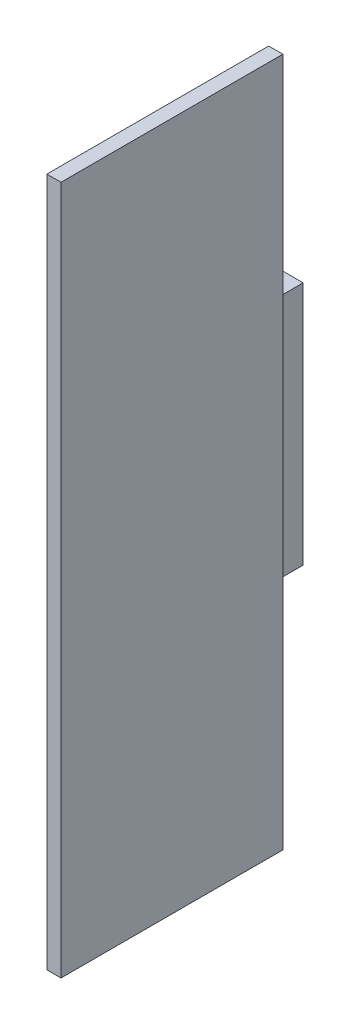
ISO-10303-21;
HEADER;
FILE_DESCRIPTION(('STEP AP214'),'2;1');
FILE_NAME('part.step','',(''),(''),'','','');
FILE_SCHEMA(('AUTOMOTIVE_DESIGN { 1 0 10303 214 1 1 1 1 }'));
ENDSEC;
DATA;
#1=APPLICATION_CONTEXT('core data for automotive mechanical design processes');
#2=APPLICATION_PROTOCOL_DEFINITION('international standard','automotive_design',2000,#1);
#3=PRODUCT_CONTEXT('',#1,'mechanical');
#4=PRODUCT('Part','Part','',(#3));
#5=PRODUCT_RELATED_PRODUCT_CATEGORY('part','',(#4));
#6=PRODUCT_DEFINITION_FORMATION('','',#4);
#7=PRODUCT_DEFINITION_CONTEXT('part definition',#1,'design');
#8=PRODUCT_DEFINITION('design','',#6,#7);
#9=PRODUCT_DEFINITION_SHAPE('','',#8);
#10=(LENGTH_UNIT() NAMED_UNIT(*) SI_UNIT(.MILLI.,.METRE.));
#11=(NAMED_UNIT(*) PLANE_ANGLE_UNIT() SI_UNIT($,.RADIAN.));
#12=(NAMED_UNIT(*) SI_UNIT($,.STERADIAN.) SOLID_ANGLE_UNIT());
#13=UNCERTAINTY_MEASURE_WITH_UNIT(LENGTH_MEASURE(1.E-05),#10,'distance_accuracy_value','');
#14=(GEOMETRIC_REPRESENTATION_CONTEXT(3) GLOBAL_UNCERTAINTY_ASSIGNED_CONTEXT((#13)) GLOBAL_UNIT_ASSIGNED_CONTEXT((#10,
#11,#12)) REPRESENTATION_CONTEXT('',''));
#15=CARTESIAN_POINT('',(0.,0.,0.));
#16=DIRECTION('',(0.,0.,1.));
#17=DIRECTION('',(1.,0.,0.));
#18=AXIS2_PLACEMENT_3D('',#15,#16,#17);
#19=CARTESIAN_POINT('',(0.,73.,47.));
#20=DIRECTION('',(-1.,0.,0.));
#21=DIRECTION('',(0.,-1.,0.));
#22=AXIS2_PLACEMENT_3D('',#19,#20,#21);
#23=PLANE('',#22);
#24=DIRECTION('',(0.,-1.,0.));
#25=VECTOR('',#24,1.);
#26=CARTESIAN_POINT('',(0.,-35.,7.69999999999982));
#27=LINE('',#26,#25);
#28=CARTESIAN_POINT('',(0.,35.,7.69999999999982));
#29=VERTEX_POINT('',#28);
#30=CARTESIAN_POINT('',(0.,-35.,7.69999999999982));
#31=VERTEX_POINT('',#30);
#32=EDGE_CURVE('E32',#29,#31,#27,.T.);
#33=ORIENTED_EDGE('',*,*,#32,.T.);
#34=DIRECTION('',(0.,0.,-1.));
#35=VECTOR('',#34,1.);
#36=CARTESIAN_POINT('',(0.,-35.,0.));
#37=LINE('',#36,#35);
#38=CARTESIAN_POINT('',(0.,-35.,0.));
#39=VERTEX_POINT('',#38);
#40=EDGE_CURVE('E18',#31,#39,#37,.T.);
#41=ORIENTED_EDGE('',*,*,#40,.T.);
#42=DIRECTION('',(0.,1.,0.));
#43=VECTOR('',#42,1.);
#44=CARTESIAN_POINT('',(0.,-73.,0.));
#45=LINE('',#44,#43);
#46=CARTESIAN_POINT('',(0.,-73.,0.));
#47=VERTEX_POINT('',#46);
#48=EDGE_CURVE('E178',#47,#39,#45,.T.);
#49=ORIENTED_EDGE('',*,*,#48,.F.);
#50=DIRECTION('',(0.,0.,-1.));
#51=VECTOR('',#50,1.);
#52=CARTESIAN_POINT('',(0.,-73.,47.));
#53=LINE('',#52,#51);
#54=CARTESIAN_POINT('',(0.,-73.,47.));
#55=VERTEX_POINT('',#54);
#56=EDGE_CURVE('E165',#55,#47,#53,.T.);
#57=ORIENTED_EDGE('',*,*,#56,.F.);
#58=DIRECTION('',(0.,-1.,0.));
#59=VECTOR('',#58,1.);
#60=CARTESIAN_POINT('',(0.,73.,47.));
#61=LINE('',#60,#59);
#62=CARTESIAN_POINT('',(0.,73.,47.));
#63=VERTEX_POINT('',#62);
#64=EDGE_CURVE('E155',#63,#55,#61,.T.);
#65=ORIENTED_EDGE('',*,*,#64,.F.);
#66=DIRECTION('',(0.,0.,1.));
#67=VECTOR('',#66,1.);
#68=CARTESIAN_POINT('',(0.,73.,0.));
#69=LINE('',#68,#67);
#70=CARTESIAN_POINT('',(0.,73.,0.));
#71=VERTEX_POINT('',#70);
#72=EDGE_CURVE('E170',#71,#63,#69,.T.);
#73=ORIENTED_EDGE('',*,*,#72,.F.);
#74=CARTESIAN_POINT('',(0.,34.9999999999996,0.));
#75=VERTEX_POINT('',#74);
#76=EDGE_CURVE('E167',#75,#71,#45,.T.);
#77=ORIENTED_EDGE('',*,*,#76,.F.);
#78=DIRECTION('',(0.,0.,1.));
#79=VECTOR('',#78,1.);
#80=CARTESIAN_POINT('',(0.,35.,7.69999999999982));
#81=LINE('',#80,#79);
#82=EDGE_CURVE('E125',#75,#29,#81,.T.);
#83=ORIENTED_EDGE('',*,*,#82,.T.);
#84=EDGE_LOOP('',(#33,#41,#49,#57,#65,#73,#77,#83));
#85=FACE_BOUND('',#84,.T.);
#86=ADVANCED_FACE('F14',(#85),#23,.T.);
#87=CARTESIAN_POINT('',(3.,73.,47.));
#88=DIRECTION('',(0.,0.,-1.));
#89=DIRECTION('',(0.,1.,0.));
#90=AXIS2_PLACEMENT_3D('',#87,#88,#89);
#91=PLANE('',#90);
#92=ORIENTED_EDGE('',*,*,#64,.T.);
#93=DIRECTION('',(-1.,0.,0.));
#94=VECTOR('',#93,1.);
#95=CARTESIAN_POINT('',(3.,-73.,47.));
#96=LINE('',#95,#94);
#97=CARTESIAN_POINT('',(3.,-73.,47.));
#98=VERTEX_POINT('',#97);
#99=EDGE_CURVE('E9',#98,#55,#96,.T.);
#100=ORIENTED_EDGE('',*,*,#99,.F.);
#101=DIRECTION('',(0.,-1.,0.));
#102=VECTOR('',#101,1.);
#103=CARTESIAN_POINT('',(3.,73.,47.));
#104=LINE('',#103,#102);
#105=CARTESIAN_POINT('',(3.,73.,47.));
#106=VERTEX_POINT('',#105);
#107=EDGE_CURVE('E196',#106,#98,#104,.T.);
#108=ORIENTED_EDGE('',*,*,#107,.F.);
#109=DIRECTION('',(-1.,0.,0.));
#110=VECTOR('',#109,1.);
#111=CARTESIAN_POINT('',(3.,73.,47.));
#112=LINE('',#111,#110);
#113=EDGE_CURVE('E193',#106,#63,#112,.T.);
#114=ORIENTED_EDGE('',*,*,#113,.T.);
#115=EDGE_LOOP('',(#92,#100,#108,#114));
#116=FACE_BOUND('',#115,.T.);
#117=ADVANCED_FACE('F16',(#116),#91,.F.);
#118=CARTESIAN_POINT('',(3.,-73.,47.));
#119=DIRECTION('',(0.,1.,0.));
#120=DIRECTION('',(0.,0.,1.));
#121=AXIS2_PLACEMENT_3D('',#118,#119,#120);
#122=PLANE('',#121);
#123=ORIENTED_EDGE('',*,*,#56,.T.);
#124=DIRECTION('',(-1.,0.,0.));
#125=VECTOR('',#124,1.);
#126=CARTESIAN_POINT('',(3.,-73.,0.));
#127=LINE('',#126,#125);
#128=CARTESIAN_POINT('',(3.,-73.,0.));
#129=VERTEX_POINT('',#128);
#130=EDGE_CURVE('E24',#129,#47,#127,.T.);
#131=ORIENTED_EDGE('',*,*,#130,.F.);
#132=DIRECTION('',(0.,0.,-1.));
#133=VECTOR('',#132,1.);
#134=CARTESIAN_POINT('',(3.,-73.,47.));
#135=LINE('',#134,#133);
#136=EDGE_CURVE('E197',#98,#129,#135,.T.);
#137=ORIENTED_EDGE('',*,*,#136,.F.);
#138=ORIENTED_EDGE('',*,*,#99,.T.);
#139=EDGE_LOOP('',(#123,#131,#137,#138));
#140=FACE_BOUND('',#139,.T.);
#141=ADVANCED_FACE('F208',(#140),#122,.F.);
#142=CARTESIAN_POINT('',(3.,-73.,0.));
#143=DIRECTION('',(0.,0.,1.));
#144=DIRECTION('',(1.,0.,0.));
#145=AXIS2_PLACEMENT_3D('',#142,#143,#144);
#146=PLANE('',#145);
#147=ORIENTED_EDGE('',*,*,#48,.T.);
#148=DIRECTION('',(1.,0.,0.));
#149=VECTOR('',#148,1.);
#150=CARTESIAN_POINT('',(-6.,-35.,0.));
#151=LINE('',#150,#149);
#152=CARTESIAN_POINT('',(-6.,-35.,0.));
#153=VERTEX_POINT('',#152);
#154=EDGE_CURVE('E113',#153,#39,#151,.T.);
#155=ORIENTED_EDGE('',*,*,#154,.F.);
#156=DIRECTION('',(0.,1.,0.));
#157=VECTOR('',#156,1.);
#158=CARTESIAN_POINT('',(-6.,-35.,0.));
#159=LINE('',#158,#157);
#160=CARTESIAN_POINT('',(-6.,-25.9,0.));
#161=VERTEX_POINT('',#160);
#162=EDGE_CURVE('E136',#153,#161,#159,.T.);
#163=ORIENTED_EDGE('',*,*,#162,.T.);
#164=DIRECTION('',(1.,0.,0.));
#165=VECTOR('',#164,1.);
#166=CARTESIAN_POINT('',(-6.,-25.9,0.));
#167=LINE('',#166,#165);
#168=CARTESIAN_POINT('',(0.,-25.9,0.));
#169=VERTEX_POINT('',#168);
#170=EDGE_CURVE('E161',#161,#169,#167,.T.);
#171=ORIENTED_EDGE('',*,*,#170,.T.);
#172=CARTESIAN_POINT('',(0.,25.9,0.));
#173=VERTEX_POINT('',#172);
#174=EDGE_CURVE('E179',#169,#173,#45,.T.);
#175=ORIENTED_EDGE('',*,*,#174,.T.);
#176=DIRECTION('',(1.,0.,0.));
#177=VECTOR('',#176,1.);
#178=CARTESIAN_POINT('',(-6.,25.9,0.));
#179=LINE('',#178,#177);
#180=CARTESIAN_POINT('',(-6.,25.9,0.));
#181=VERTEX_POINT('',#180);
#182=EDGE_CURVE('E159',#181,#173,#179,.T.);
#183=ORIENTED_EDGE('',*,*,#182,.F.);
#184=DIRECTION('',(0.,1.,0.));
#185=VECTOR('',#184,1.);
#186=CARTESIAN_POINT('',(-6.,25.9,0.));
#187=LINE('',#186,#185);
#188=CARTESIAN_POINT('',(-6.,34.9999999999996,0.));
#189=VERTEX_POINT('',#188);
#190=EDGE_CURVE('E148',#181,#189,#187,.T.);
#191=ORIENTED_EDGE('',*,*,#190,.T.);
#192=DIRECTION('',(1.,0.,0.));
#193=VECTOR('',#192,1.);
#194=CARTESIAN_POINT('',(-6.,34.9999999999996,0.));
#195=LINE('',#194,#193);
#196=EDGE_CURVE('E156',#189,#75,#195,.T.);
#197=ORIENTED_EDGE('',*,*,#196,.T.);
#198=ORIENTED_EDGE('',*,*,#76,.T.);
#199=DIRECTION('',(-1.,0.,0.));
#200=VECTOR('',#199,1.);
#201=CARTESIAN_POINT('',(3.,73.,0.));
#202=LINE('',#201,#200);
#203=CARTESIAN_POINT('',(3.,73.,0.));
#204=VERTEX_POINT('',#203);
#205=EDGE_CURVE('E188',#204,#71,#202,.T.);
#206=ORIENTED_EDGE('',*,*,#205,.F.);
#207=DIRECTION('',(0.,1.,0.));
#208=VECTOR('',#207,1.);
#209=CARTESIAN_POINT('',(3.,-73.,0.));
#210=LINE('',#209,#208);
#211=EDGE_CURVE('E200',#129,#204,#210,.T.);
#212=ORIENTED_EDGE('',*,*,#211,.F.);
#213=ORIENTED_EDGE('',*,*,#130,.T.);
#214=EDGE_LOOP('',(#147,#155,#163,#171,#175,#183,#191,#197,#198,#206,#212,#213));
#215=FACE_BOUND('',#214,.T.);
#216=ADVANCED_FACE('F186',(#215),#146,.F.);
#217=CARTESIAN_POINT('',(3.,73.,0.));
#218=DIRECTION('',(0.,-1.,0.));
#219=DIRECTION('',(0.,0.,-1.));
#220=AXIS2_PLACEMENT_3D('',#217,#218,#219);
#221=PLANE('',#220);
#222=ORIENTED_EDGE('',*,*,#72,.T.);
#223=ORIENTED_EDGE('',*,*,#113,.F.);
#224=DIRECTION('',(0.,0.,1.));
#225=VECTOR('',#224,1.);
#226=CARTESIAN_POINT('',(3.,73.,0.));
#227=LINE('',#226,#225);
#228=EDGE_CURVE('E40',#204,#106,#227,.T.);
#229=ORIENTED_EDGE('',*,*,#228,.F.);
#230=ORIENTED_EDGE('',*,*,#205,.T.);
#231=EDGE_LOOP('',(#222,#223,#229,#230));
#232=FACE_BOUND('',#231,.T.);
#233=ADVANCED_FACE('F191',(#232),#221,.F.);
#234=CARTESIAN_POINT('',(3.,73.,47.));
#235=DIRECTION('',(-1.,0.,0.));
#236=DIRECTION('',(0.,-1.,0.));
#237=AXIS2_PLACEMENT_3D('',#234,#235,#236);
#238=PLANE('',#237);
#239=ORIENTED_EDGE('',*,*,#107,.T.);
#240=ORIENTED_EDGE('',*,*,#136,.T.);
#241=ORIENTED_EDGE('',*,*,#211,.T.);
#242=ORIENTED_EDGE('',*,*,#228,.T.);
#243=EDGE_LOOP('',(#239,#240,#241,#242));
#244=FACE_BOUND('',#243,.T.);
#245=ADVANCED_FACE('F224',(#244),#238,.F.);
#246=CARTESIAN_POINT('',(0.,25.9,7.69999999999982));
#247=DIRECTION('',(1.,0.,0.));
#248=DIRECTION('',(0.,1.,0.));
#249=AXIS2_PLACEMENT_3D('',#246,#247,#248);
#250=PLANE('',#249);
#251=ORIENTED_EDGE('',*,*,#174,.F.);
#252=DIRECTION('',(0.,0.,-1.));
#253=VECTOR('',#252,1.);
#254=CARTESIAN_POINT('',(0.,-25.9,0.));
#255=LINE('',#254,#253);
#256=CARTESIAN_POINT('',(0.,-25.9,-7.30000000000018));
#257=VERTEX_POINT('',#256);
#258=EDGE_CURVE('E121',#169,#257,#255,.T.);
#259=ORIENTED_EDGE('',*,*,#258,.T.);
#260=DIRECTION('',(0.,1.,0.));
#261=VECTOR('',#260,1.);
#262=CARTESIAN_POINT('',(0.,-25.9,-7.30000000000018));
#263=LINE('',#262,#261);
#264=CARTESIAN_POINT('',(0.,25.9,-7.30000000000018));
#265=VERTEX_POINT('',#264);
#266=EDGE_CURVE('E129',#257,#265,#263,.T.);
#267=ORIENTED_EDGE('',*,*,#266,.T.);
#268=DIRECTION('',(0.,0.,1.));
#269=VECTOR('',#268,1.);
#270=CARTESIAN_POINT('',(0.,25.9,-7.30000000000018));
#271=LINE('',#270,#269);
#272=EDGE_CURVE('E132',#265,#173,#271,.T.);
#273=ORIENTED_EDGE('',*,*,#272,.T.);
#274=EDGE_LOOP('',(#251,#259,#267,#273));
#275=FACE_BOUND('',#274,.T.);
#276=ADVANCED_FACE('F227',(#275),#250,.T.);
#277=CARTESIAN_POINT('',(-6.,-35.,7.69999999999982));
#278=DIRECTION('',(0.,0.,1.));
#279=DIRECTION('',(1.,0.,0.));
#280=AXIS2_PLACEMENT_3D('',#277,#278,#279);
#281=PLANE('',#280);
#282=ORIENTED_EDGE('',*,*,#32,.F.);
#283=DIRECTION('',(1.,0.,0.));
#284=VECTOR('',#283,1.);
#285=CARTESIAN_POINT('',(-6.,35.,7.69999999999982));
#286=LINE('',#285,#284);
#287=CARTESIAN_POINT('',(-6.,35.,7.69999999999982));
#288=VERTEX_POINT('',#287);
#289=EDGE_CURVE('E153',#288,#29,#286,.T.);
#290=ORIENTED_EDGE('',*,*,#289,.F.);
#291=DIRECTION('',(0.,-1.,0.));
#292=VECTOR('',#291,1.);
#293=CARTESIAN_POINT('',(-6.,-35.,7.69999999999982));
#294=LINE('',#293,#292);
#295=CARTESIAN_POINT('',(-6.,-35.,7.69999999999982));
#296=VERTEX_POINT('',#295);
#297=EDGE_CURVE('E109',#288,#296,#294,.T.);
#298=ORIENTED_EDGE('',*,*,#297,.T.);
#299=DIRECTION('',(1.,0.,0.));
#300=VECTOR('',#299,1.);
#301=CARTESIAN_POINT('',(-6.,-35.,7.69999999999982));
#302=LINE('',#301,#300);
#303=EDGE_CURVE('E105',#296,#31,#302,.T.);
#304=ORIENTED_EDGE('',*,*,#303,.T.);
#305=EDGE_LOOP('',(#282,#290,#298,#304));
#306=FACE_BOUND('',#305,.T.);
#307=ADVANCED_FACE('F107',(#306),#281,.T.);
#308=CARTESIAN_POINT('',(-6.,35.,7.69999999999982));
#309=DIRECTION('',(0.,1.,0.));
#310=DIRECTION('',(0.,0.,1.));
#311=AXIS2_PLACEMENT_3D('',#308,#309,#310);
#312=PLANE('',#311);
#313=ORIENTED_EDGE('',*,*,#82,.F.);
#314=ORIENTED_EDGE('',*,*,#196,.F.);
#315=DIRECTION('',(0.,0.,1.));
#316=VECTOR('',#315,1.);
#317=CARTESIAN_POINT('',(-6.,35.,7.69999999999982));
#318=LINE('',#317,#316);
#319=EDGE_CURVE('E114',#189,#288,#318,.T.);
#320=ORIENTED_EDGE('',*,*,#319,.T.);
#321=ORIENTED_EDGE('',*,*,#289,.T.);
#322=EDGE_LOOP('',(#313,#314,#320,#321));
#323=FACE_BOUND('',#322,.T.);
#324=ADVANCED_FACE('F265',(#323),#312,.T.);
#325=CARTESIAN_POINT('',(-6.,25.9,-7.30000000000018));
#326=DIRECTION('',(0.,1.,0.));
#327=DIRECTION('',(-1.,0.,0.));
#328=AXIS2_PLACEMENT_3D('',#325,#326,#327);
#329=PLANE('',#328);
#330=ORIENTED_EDGE('',*,*,#272,.F.);
#331=DIRECTION('',(1.,0.,0.));
#332=VECTOR('',#331,1.);
#333=CARTESIAN_POINT('',(-6.,25.9,-7.30000000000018));
#334=LINE('',#333,#332);
#335=CARTESIAN_POINT('',(-6.,25.9,-7.30000000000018));
#336=VERTEX_POINT('',#335);
#337=EDGE_CURVE('E157',#336,#265,#334,.T.);
#338=ORIENTED_EDGE('',*,*,#337,.F.);
#339=DIRECTION('',(0.,0.,1.));
#340=VECTOR('',#339,1.);
#341=CARTESIAN_POINT('',(-6.,25.9,-7.30000000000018));
#342=LINE('',#341,#340);
#343=EDGE_CURVE('E145',#336,#181,#342,.T.);
#344=ORIENTED_EDGE('',*,*,#343,.T.);
#345=ORIENTED_EDGE('',*,*,#182,.T.);
#346=EDGE_LOOP('',(#330,#338,#344,#345));
#347=FACE_BOUND('',#346,.T.);
#348=ADVANCED_FACE('F272',(#347),#329,.T.);
#349=CARTESIAN_POINT('',(-6.,-25.9,-7.30000000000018));
#350=DIRECTION('',(0.,0.,-1.));
#351=DIRECTION('',(-1.,0.,0.));
#352=AXIS2_PLACEMENT_3D('',#349,#350,#351);
#353=PLANE('',#352);
#354=ORIENTED_EDGE('',*,*,#266,.F.);
#355=DIRECTION('',(1.,0.,0.));
#356=VECTOR('',#355,1.);
#357=CARTESIAN_POINT('',(-6.,-25.9,-7.30000000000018));
#358=LINE('',#357,#356);
#359=CARTESIAN_POINT('',(-6.,-25.9,-7.30000000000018));
#360=VERTEX_POINT('',#359);
#361=EDGE_CURVE('E160',#360,#257,#358,.T.);
#362=ORIENTED_EDGE('',*,*,#361,.F.);
#363=DIRECTION('',(0.,1.,0.));
#364=VECTOR('',#363,1.);
#365=CARTESIAN_POINT('',(-6.,-25.9,-7.30000000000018));
#366=LINE('',#365,#364);
#367=EDGE_CURVE('E142',#360,#336,#366,.T.);
#368=ORIENTED_EDGE('',*,*,#367,.T.);
#369=ORIENTED_EDGE('',*,*,#337,.T.);
#370=EDGE_LOOP('',(#354,#362,#368,#369));
#371=FACE_BOUND('',#370,.T.);
#372=ADVANCED_FACE('F281',(#371),#353,.T.);
#373=CARTESIAN_POINT('',(-6.,-25.9,0.));
#374=DIRECTION('',(0.,-1.,0.));
#375=DIRECTION('',(1.,0.,0.));
#376=AXIS2_PLACEMENT_3D('',#373,#374,#375);
#377=PLANE('',#376);
#378=ORIENTED_EDGE('',*,*,#258,.F.);
#379=ORIENTED_EDGE('',*,*,#170,.F.);
#380=DIRECTION('',(0.,0.,-1.));
#381=VECTOR('',#380,1.);
#382=CARTESIAN_POINT('',(-6.,-25.9,0.));
#383=LINE('',#382,#381);
#384=EDGE_CURVE('E139',#161,#360,#383,.T.);
#385=ORIENTED_EDGE('',*,*,#384,.T.);
#386=ORIENTED_EDGE('',*,*,#361,.T.);
#387=EDGE_LOOP('',(#378,#379,#385,#386));
#388=FACE_BOUND('',#387,.T.);
#389=ADVANCED_FACE('F290',(#388),#377,.T.);
#390=CARTESIAN_POINT('',(-6.,-35.,0.));
#391=DIRECTION('',(0.,-1.,0.));
#392=DIRECTION('',(1.,0.,0.));
#393=AXIS2_PLACEMENT_3D('',#390,#391,#392);
#394=PLANE('',#393);
#395=ORIENTED_EDGE('',*,*,#40,.F.);
#396=ORIENTED_EDGE('',*,*,#303,.F.);
#397=DIRECTION('',(0.,0.,-1.));
#398=VECTOR('',#397,1.);
#399=CARTESIAN_POINT('',(-6.,-35.,0.));
#400=LINE('',#399,#398);
#401=EDGE_CURVE('E134',#296,#153,#400,.T.);
#402=ORIENTED_EDGE('',*,*,#401,.T.);
#403=ORIENTED_EDGE('',*,*,#154,.T.);
#404=EDGE_LOOP('',(#395,#396,#402,#403));
#405=FACE_BOUND('',#404,.T.);
#406=ADVANCED_FACE('F117',(#405),#394,.T.);
#407=CARTESIAN_POINT('',(-6.,25.9,7.69999999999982));
#408=DIRECTION('',(1.,0.,0.));
#409=DIRECTION('',(0.,1.,0.));
#410=AXIS2_PLACEMENT_3D('',#407,#408,#409);
#411=PLANE('',#410);
#412=ORIENTED_EDGE('',*,*,#297,.F.);
#413=ORIENTED_EDGE('',*,*,#319,.F.);
#414=ORIENTED_EDGE('',*,*,#190,.F.);
#415=ORIENTED_EDGE('',*,*,#343,.F.);
#416=ORIENTED_EDGE('',*,*,#367,.F.);
#417=ORIENTED_EDGE('',*,*,#384,.F.);
#418=ORIENTED_EDGE('',*,*,#162,.F.);
#419=ORIENTED_EDGE('',*,*,#401,.F.);
#420=EDGE_LOOP('',(#412,#413,#414,#415,#416,#417,#418,#419));
#421=FACE_BOUND('',#420,.T.);
#422=ADVANCED_FACE('F307',(#421),#411,.F.);
#423=CLOSED_SHELL('',(#86,#117,#141,#216,#233,#245,#276,#307,#324,#348,#372,#389,#406,#422));
#424=MANIFOLD_SOLID_BREP('B1',#423);
#425=ADVANCED_BREP_SHAPE_REPRESENTATION('',(#18,#424),#14);
#426=SHAPE_DEFINITION_REPRESENTATION(#9,#425);
ENDSEC;
END-ISO-10303-21;
